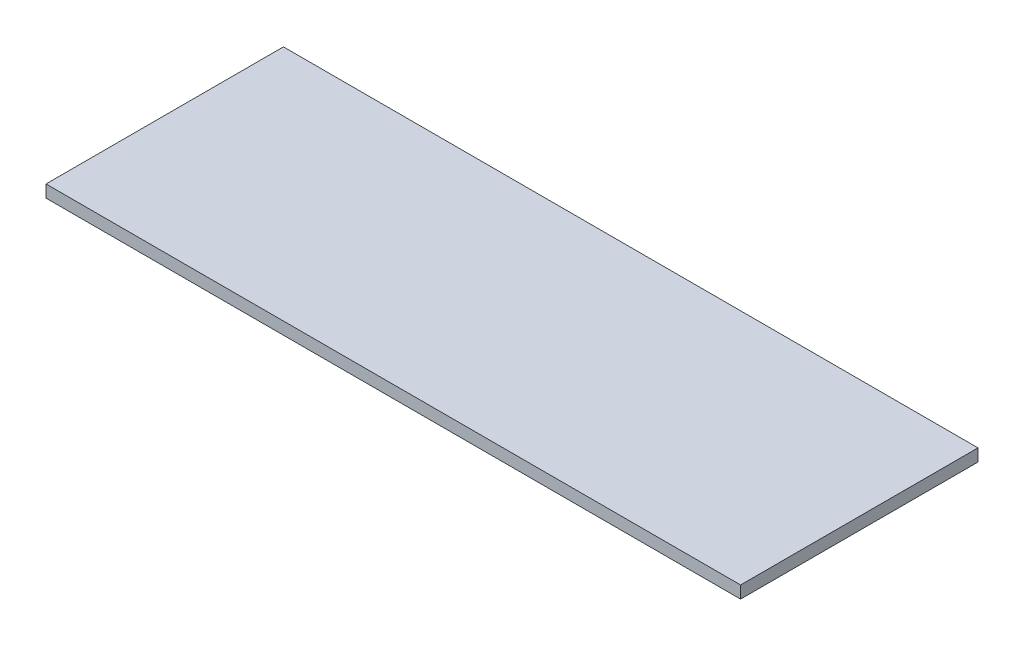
from build123d import *

# Parameters (mm, degrees)
SKETCH1_W           = 165.1
SKETCH1_H           = 56.4388
BOSS_EXTRUDE1_DEPTH = 2.921


with BuildPart() as part:
    # Sketch1 → Boss-Extrude1 (new body)
    with BuildSketch(Plane(origin=(0, 0, 0), x_dir=(1, 0, 0), z_dir=(0, 1, 0))):
        Rectangle(SKETCH1_W, SKETCH1_H)
    extrude(amount=BOSS_EXTRUDE1_DEPTH)


solid = part.part
